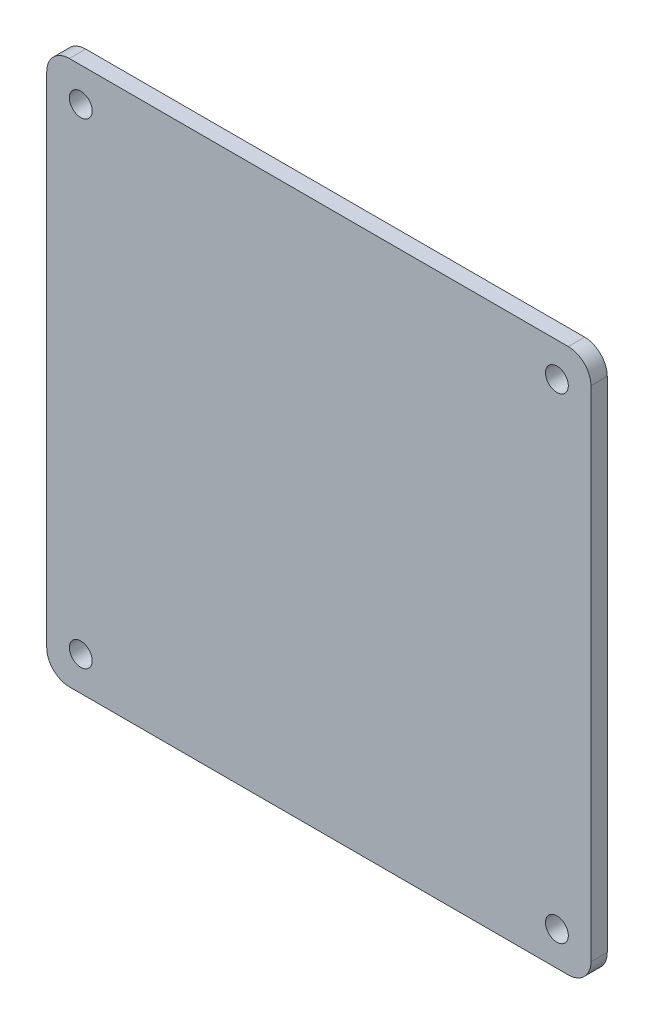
ISO-10303-21;
HEADER;
FILE_DESCRIPTION(('STEP AP214'),'2;1');
FILE_NAME('part.step','',(''),(''),'','','');
FILE_SCHEMA(('AUTOMOTIVE_DESIGN { 1 0 10303 214 1 1 1 1 }'));
ENDSEC;
DATA;
#1=APPLICATION_CONTEXT('core data for automotive mechanical design processes');
#2=APPLICATION_PROTOCOL_DEFINITION('international standard','automotive_design',2000,#1);
#3=PRODUCT_CONTEXT('',#1,'mechanical');
#4=PRODUCT('Part','Part','',(#3));
#5=PRODUCT_RELATED_PRODUCT_CATEGORY('part','',(#4));
#6=PRODUCT_DEFINITION_FORMATION('','',#4);
#7=PRODUCT_DEFINITION_CONTEXT('part definition',#1,'design');
#8=PRODUCT_DEFINITION('design','',#6,#7);
#9=PRODUCT_DEFINITION_SHAPE('','',#8);
#10=(LENGTH_UNIT() NAMED_UNIT(*) SI_UNIT(.MILLI.,.METRE.));
#11=(NAMED_UNIT(*) PLANE_ANGLE_UNIT() SI_UNIT($,.RADIAN.));
#12=(NAMED_UNIT(*) SI_UNIT($,.STERADIAN.) SOLID_ANGLE_UNIT());
#13=UNCERTAINTY_MEASURE_WITH_UNIT(LENGTH_MEASURE(1.E-05),#10,'distance_accuracy_value','');
#14=(GEOMETRIC_REPRESENTATION_CONTEXT(3) GLOBAL_UNCERTAINTY_ASSIGNED_CONTEXT((#13)) GLOBAL_UNIT_ASSIGNED_CONTEXT((#10,
#11,#12)) REPRESENTATION_CONTEXT('',''));
#15=CARTESIAN_POINT('',(0.,0.,0.));
#16=DIRECTION('',(0.,0.,1.));
#17=DIRECTION('',(1.,0.,0.));
#18=AXIS2_PLACEMENT_3D('',#15,#16,#17);
#19=CARTESIAN_POINT('',(0.,0.,3.429));
#20=DIRECTION('',(0.,0.,1.));
#21=DIRECTION('',(1.,0.,0.));
#22=AXIS2_PLACEMENT_3D('',#19,#20,#21);
#23=PLANE('',#22);
#24=CARTESIAN_POINT('',(-50.,50.,3.429));
#25=DIRECTION('',(0.,0.,1.));
#26=DIRECTION('',(1.,0.,0.));
#27=AXIS2_PLACEMENT_3D('',#24,#25,#26);
#28=CIRCLE('',#27,2.39999999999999);
#29=CARTESIAN_POINT('',(-47.6,50.,3.429));
#30=VERTEX_POINT('',#29);
#31=EDGE_CURVE('E234',#30,#30,#28,.T.);
#32=ORIENTED_EDGE('',*,*,#31,.F.);
#33=EDGE_LOOP('',(#32));
#34=FACE_BOUND('',#33,.T.);
#35=CARTESIAN_POINT('',(50.,50.,3.429));
#36=DIRECTION('',(0.,0.,1.));
#37=DIRECTION('',(1.,0.,0.));
#38=AXIS2_PLACEMENT_3D('',#35,#36,#37);
#39=CIRCLE('',#38,2.39999999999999);
#40=CARTESIAN_POINT('',(52.4,50.,3.429));
#41=VERTEX_POINT('',#40);
#42=EDGE_CURVE('E229',#41,#41,#39,.T.);
#43=ORIENTED_EDGE('',*,*,#42,.F.);
#44=EDGE_LOOP('',(#43));
#45=FACE_BOUND('',#44,.T.);
#46=CARTESIAN_POINT('',(-50.,-50.,3.429));
#47=DIRECTION('',(0.,0.,1.));
#48=DIRECTION('',(1.,0.,0.));
#49=AXIS2_PLACEMENT_3D('',#46,#47,#48);
#50=CIRCLE('',#49,2.39999999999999);
#51=CARTESIAN_POINT('',(-47.6,-50.,3.429));
#52=VERTEX_POINT('',#51);
#53=EDGE_CURVE('E223',#52,#52,#50,.T.);
#54=ORIENTED_EDGE('',*,*,#53,.F.);
#55=EDGE_LOOP('',(#54));
#56=FACE_BOUND('',#55,.T.);
#57=CARTESIAN_POINT('',(50.,-50.,3.429));
#58=DIRECTION('',(0.,0.,1.));
#59=DIRECTION('',(1.,0.,0.));
#60=AXIS2_PLACEMENT_3D('',#57,#58,#59);
#61=CIRCLE('',#60,2.39999999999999);
#62=CARTESIAN_POINT('',(52.4,-50.,3.429));
#63=VERTEX_POINT('',#62);
#64=EDGE_CURVE('E217',#63,#63,#61,.T.);
#65=ORIENTED_EDGE('',*,*,#64,.F.);
#66=EDGE_LOOP('',(#65));
#67=FACE_BOUND('',#66,.T.);
#68=DIRECTION('',(0.,1.,0.));
#69=VECTOR('',#68,1.);
#70=CARTESIAN_POINT('',(57.15,52.3875,3.429));
#71=LINE('',#70,#69);
#72=CARTESIAN_POINT('',(57.15,52.3875,3.429));
#73=VERTEX_POINT('',#72);
#74=CARTESIAN_POINT('',(57.15,-52.3875,3.429));
#75=VERTEX_POINT('',#74);
#76=EDGE_CURVE('E128',#73,#75,#71,.F.);
#77=ORIENTED_EDGE('',*,*,#76,.F.);
#78=CARTESIAN_POINT('',(52.3875,52.3875,3.429));
#79=DIRECTION('',(0.,0.,1.));
#80=DIRECTION('',(1.,0.,0.));
#81=AXIS2_PLACEMENT_3D('',#78,#79,#80);
#82=CIRCLE('',#81,4.7625);
#83=CARTESIAN_POINT('',(52.3875,57.15,3.429));
#84=VERTEX_POINT('',#83);
#85=EDGE_CURVE('E143',#84,#73,#82,.F.);
#86=ORIENTED_EDGE('',*,*,#85,.F.);
#87=DIRECTION('',(1.,0.,0.));
#88=VECTOR('',#87,1.);
#89=CARTESIAN_POINT('',(-52.3875,57.15,3.429));
#90=LINE('',#89,#88);
#91=CARTESIAN_POINT('',(-52.3875,57.15,3.429));
#92=VERTEX_POINT('',#91);
#93=EDGE_CURVE('E124',#92,#84,#90,.T.);
#94=ORIENTED_EDGE('',*,*,#93,.F.);
#95=CARTESIAN_POINT('',(-52.3875,52.3875,3.429));
#96=DIRECTION('',(0.,0.,1.));
#97=DIRECTION('',(1.,0.,0.));
#98=AXIS2_PLACEMENT_3D('',#95,#96,#97);
#99=CIRCLE('',#98,4.7625);
#100=CARTESIAN_POINT('',(-57.15,52.3875,3.429));
#101=VERTEX_POINT('',#100);
#102=EDGE_CURVE('E110',#101,#92,#99,.F.);
#103=ORIENTED_EDGE('',*,*,#102,.F.);
#104=DIRECTION('',(0.,1.,0.));
#105=VECTOR('',#104,1.);
#106=CARTESIAN_POINT('',(-57.15,-52.3875,3.429));
#107=LINE('',#106,#105);
#108=CARTESIAN_POINT('',(-57.15,-52.3875,3.429));
#109=VERTEX_POINT('',#108);
#110=EDGE_CURVE('E106',#109,#101,#107,.T.);
#111=ORIENTED_EDGE('',*,*,#110,.F.);
#112=CARTESIAN_POINT('',(-52.3875,-52.3875,3.429));
#113=DIRECTION('',(0.,0.,1.));
#114=DIRECTION('',(1.,0.,0.));
#115=AXIS2_PLACEMENT_3D('',#112,#113,#114);
#116=CIRCLE('',#115,4.7625);
#117=CARTESIAN_POINT('',(-52.3875,-57.15,3.429));
#118=VERTEX_POINT('',#117);
#119=EDGE_CURVE('E35',#118,#109,#116,.F.);
#120=ORIENTED_EDGE('',*,*,#119,.F.);
#121=DIRECTION('',(1.,0.,0.));
#122=VECTOR('',#121,1.);
#123=CARTESIAN_POINT('',(52.3875,-57.15,3.429));
#124=LINE('',#123,#122);
#125=CARTESIAN_POINT('',(52.3875,-57.15,3.429));
#126=VERTEX_POINT('',#125);
#127=EDGE_CURVE('E93',#126,#118,#124,.F.);
#128=ORIENTED_EDGE('',*,*,#127,.F.);
#129=CARTESIAN_POINT('',(52.3875,-52.3875,3.429));
#130=DIRECTION('',(0.,0.,1.));
#131=DIRECTION('',(1.,0.,0.));
#132=AXIS2_PLACEMENT_3D('',#129,#130,#131);
#133=CIRCLE('',#132,4.7625);
#134=EDGE_CURVE('E144',#75,#126,#133,.F.);
#135=ORIENTED_EDGE('',*,*,#134,.F.);
#136=EDGE_LOOP('',(#77,#86,#94,#103,#111,#120,#128,#135));
#137=FACE_BOUND('',#136,.T.);
#138=ADVANCED_FACE('F32',(#34,#45,#56,#67,#137),#23,.T.);
#139=CARTESIAN_POINT('',(-57.15,-52.3875,0.));
#140=DIRECTION('',(-1.,0.,0.));
#141=DIRECTION('',(0.,0.,1.));
#142=AXIS2_PLACEMENT_3D('',#139,#140,#141);
#143=PLANE('',#142);
#144=DIRECTION('',(0.,1.,0.));
#145=VECTOR('',#144,1.);
#146=CARTESIAN_POINT('',(-57.15,0.,0.));
#147=LINE('',#146,#145);
#148=CARTESIAN_POINT('',(-57.15,52.3875,0.));
#149=VERTEX_POINT('',#148);
#150=CARTESIAN_POINT('',(-57.15,-52.3875,0.));
#151=VERTEX_POINT('',#150);
#152=EDGE_CURVE('E118',#149,#151,#147,.F.);
#153=ORIENTED_EDGE('',*,*,#152,.T.);
#154=DIRECTION('',(0.,0.,1.));
#155=VECTOR('',#154,1.);
#156=CARTESIAN_POINT('',(-57.15,-52.3875,0.));
#157=LINE('',#156,#155);
#158=EDGE_CURVE('E102',#109,#151,#157,.F.);
#159=ORIENTED_EDGE('',*,*,#158,.F.);
#160=ORIENTED_EDGE('',*,*,#110,.T.);
#161=DIRECTION('',(0.,0.,1.));
#162=VECTOR('',#161,1.);
#163=CARTESIAN_POINT('',(-57.15,52.3875,0.));
#164=LINE('',#163,#162);
#165=EDGE_CURVE('E161',#149,#101,#164,.T.);
#166=ORIENTED_EDGE('',*,*,#165,.F.);
#167=EDGE_LOOP('',(#153,#159,#160,#166));
#168=FACE_BOUND('',#167,.T.);
#169=ADVANCED_FACE('F117',(#168),#143,.T.);
#170=CARTESIAN_POINT('',(-52.3875,-52.3875,0.));
#171=DIRECTION('',(0.,0.,1.));
#172=DIRECTION('',(1.,0.,0.));
#173=AXIS2_PLACEMENT_3D('',#170,#171,#172);
#174=CYLINDRICAL_SURFACE('',#173,4.7625);
#175=CARTESIAN_POINT('',(-52.3875,-52.3875,0.));
#176=DIRECTION('',(0.,0.,1.));
#177=DIRECTION('',(1.,0.,0.));
#178=AXIS2_PLACEMENT_3D('',#175,#176,#177);
#179=CIRCLE('',#178,4.7625);
#180=CARTESIAN_POINT('',(-52.3875,-57.15,0.));
#181=VERTEX_POINT('',#180);
#182=EDGE_CURVE('E140',#151,#181,#179,.T.);
#183=ORIENTED_EDGE('',*,*,#182,.T.);
#184=DIRECTION('',(0.,0.,-1.));
#185=VECTOR('',#184,1.);
#186=CARTESIAN_POINT('',(-52.3875,-57.15,0.));
#187=LINE('',#186,#185);
#188=EDGE_CURVE('E104',#118,#181,#187,.T.);
#189=ORIENTED_EDGE('',*,*,#188,.F.);
#190=ORIENTED_EDGE('',*,*,#119,.T.);
#191=ORIENTED_EDGE('',*,*,#158,.T.);
#192=EDGE_LOOP('',(#183,#189,#190,#191));
#193=FACE_BOUND('',#192,.T.);
#194=ADVANCED_FACE('F100',(#193),#174,.T.);
#195=CARTESIAN_POINT('',(52.3875,-57.15,0.));
#196=DIRECTION('',(0.,-1.,0.));
#197=DIRECTION('',(0.,0.,-1.));
#198=AXIS2_PLACEMENT_3D('',#195,#196,#197);
#199=PLANE('',#198);
#200=DIRECTION('',(1.,0.,0.));
#201=VECTOR('',#200,1.);
#202=CARTESIAN_POINT('',(0.,-57.15,0.));
#203=LINE('',#202,#201);
#204=CARTESIAN_POINT('',(52.3875,-57.15,0.));
#205=VERTEX_POINT('',#204);
#206=EDGE_CURVE('E139',#181,#205,#203,.T.);
#207=ORIENTED_EDGE('',*,*,#206,.T.);
#208=DIRECTION('',(0.,0.,1.));
#209=VECTOR('',#208,1.);
#210=CARTESIAN_POINT('',(52.3875,-57.15,0.));
#211=LINE('',#210,#209);
#212=EDGE_CURVE('E130',#126,#205,#211,.F.);
#213=ORIENTED_EDGE('',*,*,#212,.F.);
#214=ORIENTED_EDGE('',*,*,#127,.T.);
#215=ORIENTED_EDGE('',*,*,#188,.T.);
#216=EDGE_LOOP('',(#207,#213,#214,#215));
#217=FACE_BOUND('',#216,.T.);
#218=ADVANCED_FACE('F150',(#217),#199,.T.);
#219=CARTESIAN_POINT('',(52.3875,-52.3875,0.));
#220=DIRECTION('',(0.,0.,1.));
#221=DIRECTION('',(1.,0.,0.));
#222=AXIS2_PLACEMENT_3D('',#219,#220,#221);
#223=CYLINDRICAL_SURFACE('',#222,4.7625);
#224=CARTESIAN_POINT('',(52.3875,-52.3875,0.));
#225=DIRECTION('',(0.,0.,1.));
#226=DIRECTION('',(1.,0.,0.));
#227=AXIS2_PLACEMENT_3D('',#224,#225,#226);
#228=CIRCLE('',#227,4.7625);
#229=CARTESIAN_POINT('',(57.15,-52.3875,0.));
#230=VERTEX_POINT('',#229);
#231=EDGE_CURVE('E136',#205,#230,#228,.T.);
#232=ORIENTED_EDGE('',*,*,#231,.T.);
#233=DIRECTION('',(0.,0.,-1.));
#234=VECTOR('',#233,1.);
#235=CARTESIAN_POINT('',(57.15,-52.3875,0.));
#236=LINE('',#235,#234);
#237=EDGE_CURVE('E129',#75,#230,#236,.T.);
#238=ORIENTED_EDGE('',*,*,#237,.F.);
#239=ORIENTED_EDGE('',*,*,#134,.T.);
#240=ORIENTED_EDGE('',*,*,#212,.T.);
#241=EDGE_LOOP('',(#232,#238,#239,#240));
#242=FACE_BOUND('',#241,.T.);
#243=ADVANCED_FACE('F171',(#242),#223,.T.);
#244=CARTESIAN_POINT('',(57.15,52.3875,0.));
#245=DIRECTION('',(1.,0.,0.));
#246=DIRECTION('',(0.,0.,-1.));
#247=AXIS2_PLACEMENT_3D('',#244,#245,#246);
#248=PLANE('',#247);
#249=DIRECTION('',(0.,1.,0.));
#250=VECTOR('',#249,1.);
#251=CARTESIAN_POINT('',(57.15,0.,0.));
#252=LINE('',#251,#250);
#253=CARTESIAN_POINT('',(57.15,52.3875,0.));
#254=VERTEX_POINT('',#253);
#255=EDGE_CURVE('E135',#230,#254,#252,.T.);
#256=ORIENTED_EDGE('',*,*,#255,.T.);
#257=DIRECTION('',(0.,0.,1.));
#258=VECTOR('',#257,1.);
#259=CARTESIAN_POINT('',(57.15,52.3875,0.));
#260=LINE('',#259,#258);
#261=EDGE_CURVE('E127',#73,#254,#260,.F.);
#262=ORIENTED_EDGE('',*,*,#261,.F.);
#263=ORIENTED_EDGE('',*,*,#76,.T.);
#264=ORIENTED_EDGE('',*,*,#237,.T.);
#265=EDGE_LOOP('',(#256,#262,#263,#264));
#266=FACE_BOUND('',#265,.T.);
#267=ADVANCED_FACE('F168',(#266),#248,.T.);
#268=CARTESIAN_POINT('',(52.3875,52.3875,0.));
#269=DIRECTION('',(0.,0.,1.));
#270=DIRECTION('',(1.,0.,0.));
#271=AXIS2_PLACEMENT_3D('',#268,#269,#270);
#272=CYLINDRICAL_SURFACE('',#271,4.7625);
#273=CARTESIAN_POINT('',(52.3875,52.3875,0.));
#274=DIRECTION('',(0.,0.,1.));
#275=DIRECTION('',(1.,0.,0.));
#276=AXIS2_PLACEMENT_3D('',#273,#274,#275);
#277=CIRCLE('',#276,4.7625);
#278=CARTESIAN_POINT('',(52.3875,57.15,0.));
#279=VERTEX_POINT('',#278);
#280=EDGE_CURVE('E132',#254,#279,#277,.T.);
#281=ORIENTED_EDGE('',*,*,#280,.T.);
#282=DIRECTION('',(0.,0.,1.));
#283=VECTOR('',#282,1.);
#284=CARTESIAN_POINT('',(52.3875,57.15,0.));
#285=LINE('',#284,#283);
#286=EDGE_CURVE('E126',#84,#279,#285,.F.);
#287=ORIENTED_EDGE('',*,*,#286,.F.);
#288=ORIENTED_EDGE('',*,*,#85,.T.);
#289=ORIENTED_EDGE('',*,*,#261,.T.);
#290=EDGE_LOOP('',(#281,#287,#288,#289));
#291=FACE_BOUND('',#290,.T.);
#292=ADVANCED_FACE('F178',(#291),#272,.T.);
#293=CARTESIAN_POINT('',(-52.3875,57.15,0.));
#294=DIRECTION('',(0.,1.,0.));
#295=DIRECTION('',(0.,0.,1.));
#296=AXIS2_PLACEMENT_3D('',#293,#294,#295);
#297=PLANE('',#296);
#298=DIRECTION('',(1.,0.,0.));
#299=VECTOR('',#298,1.);
#300=CARTESIAN_POINT('',(0.,57.15,0.));
#301=LINE('',#300,#299);
#302=CARTESIAN_POINT('',(-52.3875,57.15,0.));
#303=VERTEX_POINT('',#302);
#304=EDGE_CURVE('E41',#279,#303,#301,.F.);
#305=ORIENTED_EDGE('',*,*,#304,.T.);
#306=DIRECTION('',(0.,0.,1.));
#307=VECTOR('',#306,1.);
#308=CARTESIAN_POINT('',(-52.3875,57.15,0.));
#309=LINE('',#308,#307);
#310=EDGE_CURVE('E49',#92,#303,#309,.F.);
#311=ORIENTED_EDGE('',*,*,#310,.F.);
#312=ORIENTED_EDGE('',*,*,#93,.T.);
#313=ORIENTED_EDGE('',*,*,#286,.T.);
#314=EDGE_LOOP('',(#305,#311,#312,#313));
#315=FACE_BOUND('',#314,.T.);
#316=ADVANCED_FACE('F196',(#315),#297,.T.);
#317=CARTESIAN_POINT('',(-52.3875,52.3875,0.));
#318=DIRECTION('',(0.,0.,1.));
#319=DIRECTION('',(1.,0.,0.));
#320=AXIS2_PLACEMENT_3D('',#317,#318,#319);
#321=CYLINDRICAL_SURFACE('',#320,4.7625);
#322=CARTESIAN_POINT('',(-52.3875,52.3875,0.));
#323=DIRECTION('',(0.,0.,1.));
#324=DIRECTION('',(1.,0.,0.));
#325=AXIS2_PLACEMENT_3D('',#322,#323,#324);
#326=CIRCLE('',#325,4.7625);
#327=EDGE_CURVE('E11',#303,#149,#326,.T.);
#328=ORIENTED_EDGE('',*,*,#327,.T.);
#329=ORIENTED_EDGE('',*,*,#165,.T.);
#330=ORIENTED_EDGE('',*,*,#102,.T.);
#331=ORIENTED_EDGE('',*,*,#310,.T.);
#332=EDGE_LOOP('',(#328,#329,#330,#331));
#333=FACE_BOUND('',#332,.T.);
#334=ADVANCED_FACE('F184',(#333),#321,.T.);
#335=CARTESIAN_POINT('',(0.,0.,0.));
#336=DIRECTION('',(0.,0.,1.));
#337=DIRECTION('',(1.,0.,0.));
#338=AXIS2_PLACEMENT_3D('',#335,#336,#337);
#339=PLANE('',#338);
#340=CARTESIAN_POINT('',(-50.,50.,0.));
#341=DIRECTION('',(0.,0.,1.));
#342=DIRECTION('',(1.,0.,0.));
#343=AXIS2_PLACEMENT_3D('',#340,#341,#342);
#344=CIRCLE('',#343,2.39999999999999);
#345=CARTESIAN_POINT('',(-47.6,50.,0.));
#346=VERTEX_POINT('',#345);
#347=EDGE_CURVE('E232',#346,#346,#344,.T.);
#348=ORIENTED_EDGE('',*,*,#347,.T.);
#349=EDGE_LOOP('',(#348));
#350=FACE_BOUND('',#349,.T.);
#351=CARTESIAN_POINT('',(50.,50.,0.));
#352=DIRECTION('',(0.,0.,1.));
#353=DIRECTION('',(1.,0.,0.));
#354=AXIS2_PLACEMENT_3D('',#351,#352,#353);
#355=CIRCLE('',#354,2.39999999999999);
#356=CARTESIAN_POINT('',(52.4,50.,0.));
#357=VERTEX_POINT('',#356);
#358=EDGE_CURVE('E226',#357,#357,#355,.T.);
#359=ORIENTED_EDGE('',*,*,#358,.T.);
#360=EDGE_LOOP('',(#359));
#361=FACE_BOUND('',#360,.T.);
#362=CARTESIAN_POINT('',(-50.,-50.,0.));
#363=DIRECTION('',(0.,0.,1.));
#364=DIRECTION('',(1.,0.,0.));
#365=AXIS2_PLACEMENT_3D('',#362,#363,#364);
#366=CIRCLE('',#365,2.39999999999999);
#367=CARTESIAN_POINT('',(-47.6,-50.,0.));
#368=VERTEX_POINT('',#367);
#369=EDGE_CURVE('E220',#368,#368,#366,.T.);
#370=ORIENTED_EDGE('',*,*,#369,.T.);
#371=EDGE_LOOP('',(#370));
#372=FACE_BOUND('',#371,.T.);
#373=CARTESIAN_POINT('',(50.,-50.,0.));
#374=DIRECTION('',(0.,0.,1.));
#375=DIRECTION('',(1.,0.,0.));
#376=AXIS2_PLACEMENT_3D('',#373,#374,#375);
#377=CIRCLE('',#376,2.39999999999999);
#378=CARTESIAN_POINT('',(52.4,-50.,0.));
#379=VERTEX_POINT('',#378);
#380=EDGE_CURVE('E114',#379,#379,#377,.T.);
#381=ORIENTED_EDGE('',*,*,#380,.T.);
#382=EDGE_LOOP('',(#381));
#383=FACE_BOUND('',#382,.T.);
#384=ORIENTED_EDGE('',*,*,#304,.F.);
#385=ORIENTED_EDGE('',*,*,#280,.F.);
#386=ORIENTED_EDGE('',*,*,#255,.F.);
#387=ORIENTED_EDGE('',*,*,#231,.F.);
#388=ORIENTED_EDGE('',*,*,#206,.F.);
#389=ORIENTED_EDGE('',*,*,#182,.F.);
#390=ORIENTED_EDGE('',*,*,#152,.F.);
#391=ORIENTED_EDGE('',*,*,#327,.F.);
#392=EDGE_LOOP('',(#384,#385,#386,#387,#388,#389,#390,#391));
#393=FACE_BOUND('',#392,.T.);
#394=ADVANCED_FACE('F154',(#350,#361,#372,#383,#393),#339,.F.);
#395=CARTESIAN_POINT('',(50.,-50.,3.429));
#396=DIRECTION('',(0.,0.,1.));
#397=DIRECTION('',(1.,0.,0.));
#398=AXIS2_PLACEMENT_3D('',#395,#396,#397);
#399=CYLINDRICAL_SURFACE('',#398,2.39999999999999);
#400=ORIENTED_EDGE('',*,*,#380,.F.);
#401=EDGE_LOOP('',(#400));
#402=FACE_BOUND('',#401,.T.);
#403=ORIENTED_EDGE('',*,*,#64,.T.);
#404=EDGE_LOOP('',(#403));
#405=FACE_BOUND('',#404,.T.);
#406=ADVANCED_FACE('F183',(#402,#405),#399,.F.);
#407=CARTESIAN_POINT('',(-50.,-50.,3.429));
#408=DIRECTION('',(0.,0.,1.));
#409=DIRECTION('',(1.,0.,0.));
#410=AXIS2_PLACEMENT_3D('',#407,#408,#409);
#411=CYLINDRICAL_SURFACE('',#410,2.39999999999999);
#412=ORIENTED_EDGE('',*,*,#369,.F.);
#413=EDGE_LOOP('',(#412));
#414=FACE_BOUND('',#413,.T.);
#415=ORIENTED_EDGE('',*,*,#53,.T.);
#416=EDGE_LOOP('',(#415));
#417=FACE_BOUND('',#416,.T.);
#418=ADVANCED_FACE('F192',(#414,#417),#411,.F.);
#419=CARTESIAN_POINT('',(50.,50.,3.429));
#420=DIRECTION('',(0.,0.,1.));
#421=DIRECTION('',(1.,0.,0.));
#422=AXIS2_PLACEMENT_3D('',#419,#420,#421);
#423=CYLINDRICAL_SURFACE('',#422,2.39999999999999);
#424=ORIENTED_EDGE('',*,*,#358,.F.);
#425=EDGE_LOOP('',(#424));
#426=FACE_BOUND('',#425,.T.);
#427=ORIENTED_EDGE('',*,*,#42,.T.);
#428=EDGE_LOOP('',(#427));
#429=FACE_BOUND('',#428,.T.);
#430=ADVANCED_FACE('F249',(#426,#429),#423,.F.);
#431=CARTESIAN_POINT('',(-50.,50.,3.429));
#432=DIRECTION('',(0.,0.,1.));
#433=DIRECTION('',(1.,0.,0.));
#434=AXIS2_PLACEMENT_3D('',#431,#432,#433);
#435=CYLINDRICAL_SURFACE('',#434,2.39999999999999);
#436=ORIENTED_EDGE('',*,*,#347,.F.);
#437=EDGE_LOOP('',(#436));
#438=FACE_BOUND('',#437,.T.);
#439=ORIENTED_EDGE('',*,*,#31,.T.);
#440=EDGE_LOOP('',(#439));
#441=FACE_BOUND('',#440,.T.);
#442=ADVANCED_FACE('F238',(#438,#441),#435,.F.);
#443=CLOSED_SHELL('',(#138,#169,#194,#218,#243,#267,#292,#316,#334,#394,#406,#418,#430,#442));
#444=MANIFOLD_SOLID_BREP('B2',#443);
#445=ADVANCED_BREP_SHAPE_REPRESENTATION('',(#18,#444),#14);
#446=SHAPE_DEFINITION_REPRESENTATION(#9,#445);
ENDSEC;
END-ISO-10303-21;
